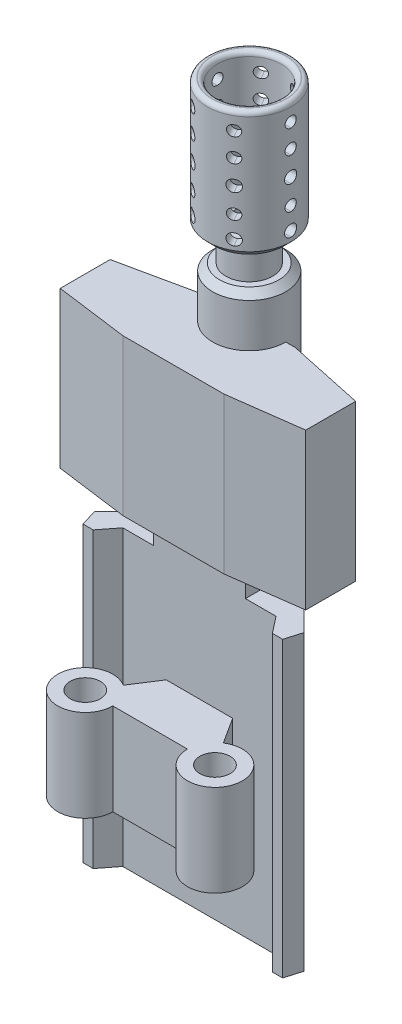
from build123d import *

# Parameters (mm, degrees)
SKETCH1_R                = 6
SKETCH1_R_2              = 3.3
BOSS_EXTRUDE1_DEPTH      = 20
BOSS_EXTRUDE2_DEPTH      = 24
BOSS_EXTRUDE2_DEPTH_BACK = 40
SKETCH3_W                = 20.089282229
SKETCH3_H                = 10.881310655
BOSS_EXTRUDE3_DEPTH      = 8
SKETCH4_W                = 10.044641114
SKETCH4_H                = 10.881310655
SKETCH4_W_2              = 10.044641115
BOSS_EXTRUDE4_DEPTH      = 34
BOSS_EXTRUDE5_DEPTH      = 11
BOSS_EXTRUDE5_DEPTH_BACK = 56
SKETCH5_R                = 7.968445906
CHAMFER1_SIZE            = 5
SKETCH6_R                = 5.107617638
BOSS_EXTRUDE6_DEPTH      = 7
CHAMFER2_SIZE            = 1.5
SKETCH7_R                = 9.109311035
BOSS_EXTRUDE7_DEPTH      = 28
CHAMFER3_SIZE            = 1.5
SKETCH8_R                = 7.019263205
CUT_EXTRUDE1_DEPTH       = 27
SKETCH10_R               = 3.565794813
CUT_EXTRUDE3_DEPTH       = 23
FILLET1_R                = 1
SKETCH11_R               = 1.147454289
SKETCH11_R_2             = 1.158434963
SKETCH11_R_3             = 1.256744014
SKETCH11_R_4             = 1.158966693
SKETCH11_R_5             = 1.24243871
CUT_EXTRUDE4_DEPTH       = 59
CIRPATTERN1_COUNT        = 6


with BuildPart() as part:
    # Sketch1 → Boss-Extrude1 (new body)
    # profile 1 of 3: a face of its own
    with BuildSketch(Plane(origin=(0, 0, 0), x_dir=(1, 0, 0), z_dir=(0, 1, 0))):
        with Locations((-40.934037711, 0)):
            Circle(SKETCH1_R)
        with Locations(Location((-40.934037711, 0, 0), (0, 0, 270))):
            Circle(SKETCH1_R_2, mode=Mode.SUBTRACT)
    # profile 2 of 3: a face of its own
    with BuildSketch(Plane(origin=(0, 0, 0), x_dir=(1, 0, 0), z_dir=(0, 1, 0))):
        with BuildLine():
            ThreePointArc((-37.697280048, 5.052068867), (-35.669982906, 2.879188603), (-34.934037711, 0))
            Line((-34.934037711, 0), (-18.634037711, 0))
            ThreePointArc((-18.634037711, 0), (-17.898092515, 2.879188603), (-15.870795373, 5.052068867))
            Line((-15.870795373, 5.052068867), (-20.947094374, 12.975372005))
            Line((-20.947094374, 12.975372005), (-32.620981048, 12.975372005))
            Line((-32.620981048, 12.975372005), (-37.697280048, 5.052068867))
        make_face()
    # profile 3 of 3: a face of its own
    with BuildSketch(Plane(origin=(0, 0, 0), x_dir=(1, 0, 0), z_dir=(0, 1, 0))):
        with Locations((-12.634037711, 0)):
            Circle(SKETCH1_R)
        with Locations(Location((-12.634037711, 0, 0), (0, 0, 270))):
            Circle(SKETCH1_R_2, mode=Mode.SUBTRACT)
    extrude(amount=BOSS_EXTRUDE1_DEPTH)

    # Sketch2 → Boss-Extrude2 (add, two sides: drawn at the far end of the back side and taken through both)
    with BuildSketch(Plane(origin=(0, 20, 0), x_dir=(1, 0, 0), z_dir=(0, 1, 0)).offset(-BOSS_EXTRUDE2_DEPTH_BACK)):
        Polygon((-32.620981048, 12.975372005), (-26.784037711, 12.975372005), (-26.784037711, 23.48460278), (-36.904926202, 23.48460278), (-49.637656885, 10.751872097), (-48.583823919, 7.127744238), (-46.33329055, 7.127744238), (-43.5040486, 10.751872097), (-34.045532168, 10.751872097), align=None)
        Polygon((-26.784037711, 23.48460278), (-26.784037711, 12.975372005), (-20.947094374, 12.975372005), (-19.522543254, 10.751872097), (-10.064026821, 10.751872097), (-7.234784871, 7.127744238), (-4.984251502, 7.127744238), (-3.930418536, 10.751872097), (-16.663149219, 23.48460278), align=None)
        Polygon((-34.045532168, 10.751872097), (-26.784037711, 10.751872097), (-26.784037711, 12.975372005), (-32.620981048, 12.975372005), align=None)
        Polygon((-26.784037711, 12.975372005), (-26.784037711, 10.751872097), (-19.522543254, 10.751872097), (-20.947094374, 12.975372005), align=None)
    extrude(amount=BOSS_EXTRUDE2_DEPTH + BOSS_EXTRUDE2_DEPTH_BACK)

    # Sketch3 → Boss-Extrude3 (add)
    with BuildSketch(Plane(origin=(0, 44, 0), x_dir=(1, 0, 0), z_dir=(0, 1, 0))):
        with Locations((-26.784037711, 16.192527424)):
            Rectangle(SKETCH3_W, SKETCH3_H)
    extrude(amount=BOSS_EXTRUDE3_DEPTH)

    # Sketch4 → Boss-Extrude4 (add)
    with BuildSketch(Plane(origin=(0, 52, 0), x_dir=(1, 0, 0), z_dir=(0, 1, 0))):
        Polygon((-36.828678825, 10.751872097), (-36.828678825, 21.633182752), (-53.568075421, 18.05287842), (-53.568075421, 7.171593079), (-37.797439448, 5.065445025), (-26.784037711, 5.065445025), (-26.784037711, 10.751872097), align=None)
        with Locations((-31.806358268, 16.192527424)):
            Rectangle(SKETCH4_W, SKETCH4_H)
        with Locations((-21.761717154, 16.192527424)):
            Rectangle(SKETCH4_W_2, SKETCH4_H)
        Polygon((0, 18.05287842), (-16.739396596, 21.633182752), (-16.739396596, 10.751872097), (-26.784037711, 10.751872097), (-26.784037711, 5.065445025), (-15.770635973, 5.065445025), (0, 7.171593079), align=None)
    extrude(amount=BOSS_EXTRUDE4_DEPTH)

    # Sketch5 → Boss-Extrude5 (add, two sides: drawn at the far end of the back side and taken through both)
    with BuildSketch(Plane(origin=(0, 86, 0), x_dir=(1, 0, 0), z_dir=(0, 1, 0)).offset(-BOSS_EXTRUDE5_DEPTH_BACK)):
        with Locations(Location((-26.784037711, 21.633182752, 0), (0, 0, 270))):
            Circle(SKETCH5_R)
    extrude(amount=BOSS_EXTRUDE5_DEPTH + BOSS_EXTRUDE5_DEPTH_BACK)

    # Chamfer1
    chamfer1_edges = [part.edges().sort_by_distance(p)[0] for p in [
        (-26.784037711, 30, -29.601628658),
    ]]
    chamfer(chamfer1_edges, length=CHAMFER1_SIZE)

    # Sketch6 → Boss-Extrude6 (add)
    with BuildSketch(Plane(origin=(0, 97, 0), x_dir=(1, 0, 0), z_dir=(0, 1, 0))):
        with Locations(Location((-26.784037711, 21.633182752, 0), (0, 0, 270))):
            Circle(SKETCH6_R)
    extrude(amount=BOSS_EXTRUDE6_DEPTH)

    # Chamfer2
    chamfer2_edges = [part.edges().sort_by_distance(p)[0] for p in [
        (-26.784037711, 97, -29.601628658),
    ]]
    chamfer(chamfer2_edges, length=CHAMFER2_SIZE)

    # Sketch7 → Boss-Extrude7 (add)
    with BuildSketch(Plane(origin=(0, 104, 0), x_dir=(1, 0, 0), z_dir=(0, 1, 0))):
        with Locations(Location((-26.784037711, 21.633182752, 0), (0, 0, 90))):
            Circle(SKETCH7_R)
    extrude(amount=BOSS_EXTRUDE7_DEPTH)

    # Chamfer3
    chamfer3_edges = [part.edges().sort_by_distance(p)[0] for p in [
        (-26.784037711, 104, -12.523871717),
    ]]
    chamfer(chamfer3_edges, length=CHAMFER3_SIZE)

    # Sketch8 → Cut-Extrude1 (cut)
    with BuildSketch(Plane(origin=(0, 132, 0), x_dir=(1, 0, 0), z_dir=(0, 1, 0))):
        with Locations(Location((-26.784037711, 21.633182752, 0), (0, 0, 270))):
            Circle(SKETCH8_R)
    extrude(amount=-CUT_EXTRUDE1_DEPTH, mode=Mode.SUBTRACT)

    # Sketch10 → Cut-Extrude3 (cut)
    with BuildSketch(Plane(origin=(0, 105, 0), x_dir=(1, 0, 0), z_dir=(0, 1, 0))):
        with Locations(Location((-26.784037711, 21.633182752, 0), (0, 0, 270))):
            Circle(SKETCH10_R)
    extrude(amount=-CUT_EXTRUDE3_DEPTH, mode=Mode.SUBTRACT)

    # Fillet1
    fillet1_edges = [part.edges().sort_by_distance(p)[0] for p in [
        (-26.784037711, 132, -12.523871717),
        (-26.784037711, 132, -28.652445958),
    ]]
    fillet(fillet1_edges, radius=FILLET1_R)

    # Sketch11 → Cut-Extrude4 (cut)
    with BuildSketch(Plane(origin=(10, 0, 0), x_dir=(0, 0, -1), z_dir=(1, 0, 0))):
        with Locations((21.559438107, 128.158301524)):
            Circle(SKETCH11_R)
        with Locations((21.559438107, 123.066356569)):
            Circle(SKETCH11_R_2)
        with Locations((21.559438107, 117.751994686)):
            Circle(SKETCH11_R_3)
        with Locations((21.559438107, 112.390270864)):
            Circle(SKETCH11_R_4)
        with Locations((21.559438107, 107.632684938)):
            Circle(SKETCH11_R_5)
    cut_extrude4 = extrude(amount=-CUT_EXTRUDE4_DEPTH, mode=Mode.SUBTRACT)

    # CirPattern1: Cut-Extrude4 ×6 about axis
    cirpattern1_axis = Axis((-26.784037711, 131, -21.633182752), (0, 1, 0))
    for i in range(1, CIRPATTERN1_COUNT):
        add(cut_extrude4.rotate(cirpattern1_axis, i * 360 / CIRPATTERN1_COUNT), mode=Mode.SUBTRACT)


solid = part.part
